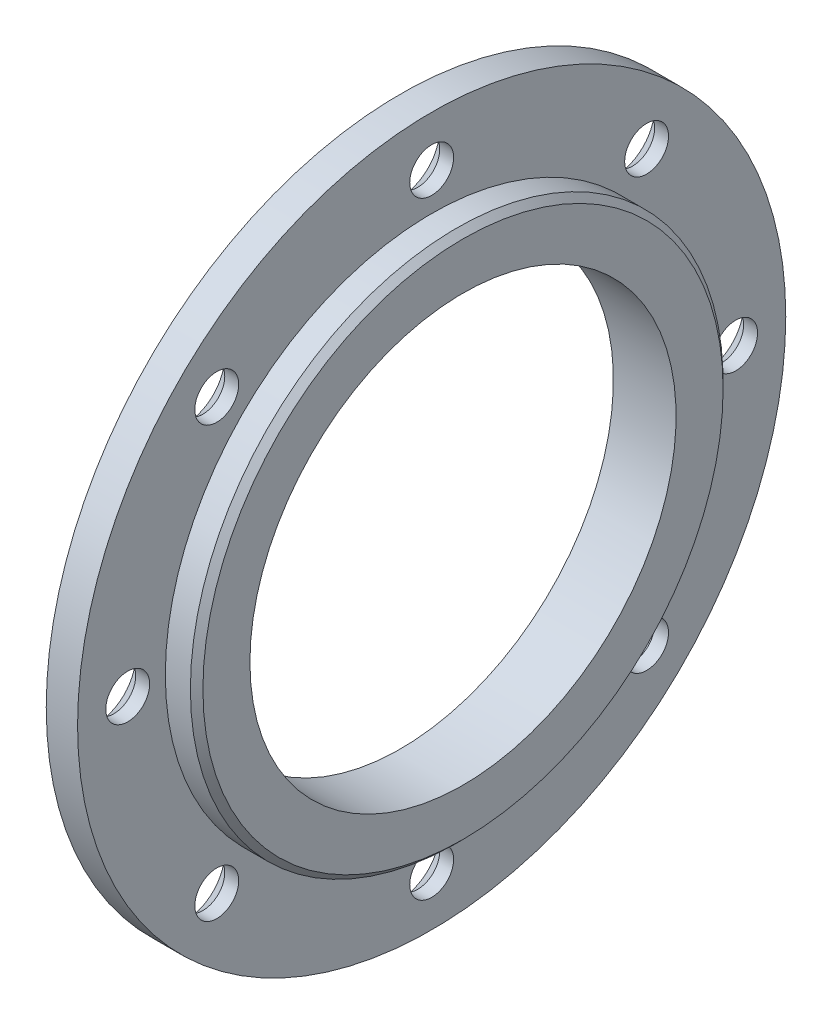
from build123d import *

# Parameters (mm, degrees)
ESQUISSE3_R                               = 3.5
EXTRUSION2_DEPTH                          = 9
CHANFREIN1_SIZE                           = 2.78
R_P_TITION_CIRCULAIRE1_COUNT              = 8
CHANFREIN1_OF_R_P_TITION_CIRCULAIRE1_SIZE = 2.78


with BuildPart() as part:
    # Esquisse1 → R_volution1 (revolve)
    with BuildSketch(Plane.XY, mode=Mode.PRIVATE) as r_volution1_sk:
        Polygon((5, 42.5), (5, 56.5), (0, 56.5), (0, 34), (10, 34), (10, 41.5), (9, 42.5), align=None)
    revolve(r_volution1_sk.sketch.rotate(Axis((-20.424351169, 0, 0), (1, 0, 0)), 90), axis=Axis((-20.424351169, 0, 0), (1, 0, 0)))

    # Esquisse3 → Extrusion2 (cut)
    with BuildSketch(Plane.ZY):
        with Locations((0, 48.5)):
            Circle(ESQUISSE3_R)
    extrusion2 = extrude(amount=-EXTRUSION2_DEPTH, mode=Mode.SUBTRACT)

    # Chanfrein1
    chanfrein1_edges = [part.edges().sort_by_distance(p)[0] for p in [
        (0, 48.5, -3.5),
    ]]
    chamfer(chanfrein1_edges, length=CHANFREIN1_SIZE)

    # R_p_tition circulaire1: Extrusion2 ×8 about axis
    r_p_tition_circulaire1_axis = Axis((0, 0, 0), (1, 0, 0))
    for i in range(1, R_P_TITION_CIRCULAIRE1_COUNT):
        add(extrusion2.rotate(r_p_tition_circulaire1_axis, i * 360 / R_P_TITION_CIRCULAIRE1_COUNT), mode=Mode.SUBTRACT)

    # Chanfrein1 of R_p_tition circulaire1
    chanfrein1_of_r_p_tition_circulaire1_edges = [part.edges().sort_by_distance(p)[0] for p in [
        (0, 36.769552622, 31.819805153),
        (0, 3.5, 48.5),
        (0, -31.819805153, 36.769552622),
        (0, -48.5, 3.5),
        (0, -36.769552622, -31.819805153),
        (0, -3.5, -48.5),
        (0, 31.819805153, -36.769552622),
    ]]
    chamfer(chanfrein1_of_r_p_tition_circulaire1_edges, length=CHANFREIN1_OF_R_P_TITION_CIRCULAIRE1_SIZE)


solid = part.part
